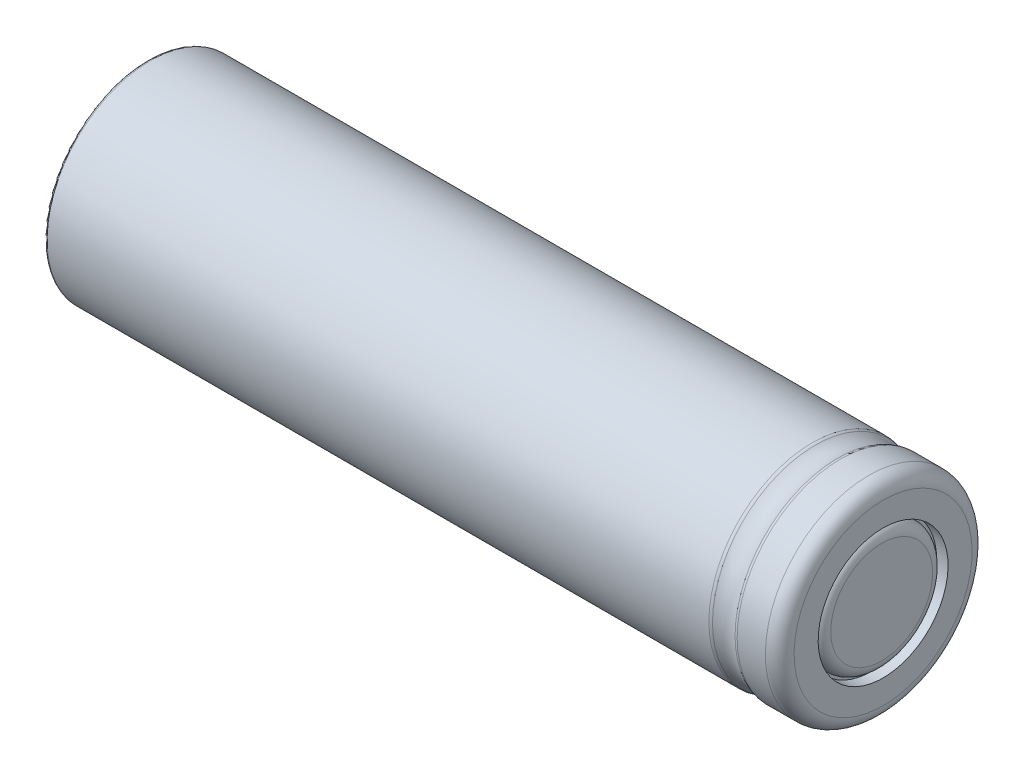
ISO-10303-21;
HEADER;
FILE_DESCRIPTION(('STEP AP214'),'2;1');
FILE_NAME('part.step','',(''),(''),'','','');
FILE_SCHEMA(('AUTOMOTIVE_DESIGN { 1 0 10303 214 1 1 1 1 }'));
ENDSEC;
DATA;
#1=APPLICATION_CONTEXT('core data for automotive mechanical design processes');
#2=APPLICATION_PROTOCOL_DEFINITION('international standard','automotive_design',2000,#1);
#3=PRODUCT_CONTEXT('',#1,'mechanical');
#4=PRODUCT('Part','Part','',(#3));
#5=PRODUCT_RELATED_PRODUCT_CATEGORY('part','',(#4));
#6=PRODUCT_DEFINITION_FORMATION('','',#4);
#7=PRODUCT_DEFINITION_CONTEXT('part definition',#1,'design');
#8=PRODUCT_DEFINITION('design','',#6,#7);
#9=PRODUCT_DEFINITION_SHAPE('','',#8);
#10=(LENGTH_UNIT() NAMED_UNIT(*) SI_UNIT(.MILLI.,.METRE.));
#11=(NAMED_UNIT(*) PLANE_ANGLE_UNIT() SI_UNIT($,.RADIAN.));
#12=(NAMED_UNIT(*) SI_UNIT($,.STERADIAN.) SOLID_ANGLE_UNIT());
#13=UNCERTAINTY_MEASURE_WITH_UNIT(LENGTH_MEASURE(1.E-05),#10,'distance_accuracy_value','');
#14=(GEOMETRIC_REPRESENTATION_CONTEXT(3) GLOBAL_UNCERTAINTY_ASSIGNED_CONTEXT((#13)) GLOBAL_UNIT_ASSIGNED_CONTEXT((#10,
#11,#12)) REPRESENTATION_CONTEXT('',''));
#15=CARTESIAN_POINT('',(0.,0.,0.));
#16=DIRECTION('',(0.,0.,1.));
#17=DIRECTION('',(1.,0.,0.));
#18=AXIS2_PLACEMENT_3D('',#15,#16,#17);
#19=CARTESIAN_POINT('',(64.084,0.,0.));
#20=DIRECTION('',(1.,0.,0.));
#21=DIRECTION('',(0.,1.,0.));
#22=AXIS2_PLACEMENT_3D('',#19,#20,#21);
#23=PLANE('',#22);
#24=CARTESIAN_POINT('',(64.084,0.,0.));
#25=DIRECTION('',(1.,0.,0.));
#26=DIRECTION('',(0.,1.,0.));
#27=AXIS2_PLACEMENT_3D('',#24,#25,#26);
#28=CIRCLE('',#27,5.75);
#29=CARTESIAN_POINT('',(64.084,5.75,0.));
#30=VERTEX_POINT('',#29);
#31=EDGE_CURVE('E71',#30,#30,#28,.T.);
#32=ORIENTED_EDGE('',*,*,#31,.T.);
#33=EDGE_LOOP('',(#32));
#34=FACE_BOUND('',#33,.T.);
#35=CARTESIAN_POINT('',(64.084,0.,0.));
#36=DIRECTION('',(1.,0.,0.));
#37=DIRECTION('',(0.,1.,0.));
#38=AXIS2_PLACEMENT_3D('',#35,#36,#37);
#39=CIRCLE('',#38,5.5);
#40=CARTESIAN_POINT('',(64.084,5.5,0.));
#41=VERTEX_POINT('',#40);
#42=EDGE_CURVE('E75',#41,#41,#39,.T.);
#43=ORIENTED_EDGE('',*,*,#42,.F.);
#44=EDGE_LOOP('',(#43));
#45=FACE_BOUND('',#44,.T.);
#46=ADVANCED_FACE('F36',(#34,#45),#23,.T.);
#47=CARTESIAN_POINT('',(65.1,7.87999999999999,0.));
#48=DIRECTION('',(1.,0.,0.));
#49=DIRECTION('',(0.,1.,0.));
#50=AXIS2_PLACEMENT_3D('',#47,#48,#49);
#51=PLANE('',#50);
#52=CARTESIAN_POINT('',(65.1,0.,0.));
#53=DIRECTION('',(1.,0.,0.));
#54=DIRECTION('',(0.,1.,0.));
#55=AXIS2_PLACEMENT_3D('',#52,#53,#54);
#56=CIRCLE('',#55,5.75);
#57=CARTESIAN_POINT('',(65.1,5.75,0.));
#58=VERTEX_POINT('',#57);
#59=EDGE_CURVE('E72',#58,#58,#56,.T.);
#60=ORIENTED_EDGE('',*,*,#59,.F.);
#61=EDGE_LOOP('',(#60));
#62=FACE_BOUND('',#61,.T.);
#63=CARTESIAN_POINT('',(65.1,0.,0.));
#64=DIRECTION('',(1.,0.,0.));
#65=DIRECTION('',(0.,1.,0.));
#66=AXIS2_PLACEMENT_3D('',#63,#64,#65);
#67=CIRCLE('',#66,7.87999999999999);
#68=CARTESIAN_POINT('',(65.1,7.87999999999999,0.));
#69=VERTEX_POINT('',#68);
#70=EDGE_CURVE('E43',#69,#69,#67,.T.);
#71=ORIENTED_EDGE('',*,*,#70,.T.);
#72=EDGE_LOOP('',(#71));
#73=FACE_BOUND('',#72,.T.);
#74=ADVANCED_FACE('F141',(#62,#73),#51,.T.);
#75=CARTESIAN_POINT('',(63.83,0.,0.));
#76=DIRECTION('',(1.,0.,0.));
#77=DIRECTION('',(0.,1.,0.));
#78=AXIS2_PLACEMENT_3D('',#75,#76,#77);
#79=TOROIDAL_SURFACE('',#78,7.87999999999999,1.27);
#80=CARTESIAN_POINT('',(63.83,0.,0.));
#81=DIRECTION('',(1.,0.,0.));
#82=DIRECTION('',(0.,1.,0.));
#83=AXIS2_PLACEMENT_3D('',#80,#81,#82);
#84=CIRCLE('',#83,9.14999999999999);
#85=CARTESIAN_POINT('',(63.83,9.14999999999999,0.));
#86=VERTEX_POINT('',#85);
#87=EDGE_CURVE('E47',#86,#86,#84,.T.);
#88=ORIENTED_EDGE('',*,*,#87,.T.);
#89=EDGE_LOOP('',(#88));
#90=FACE_BOUND('',#89,.T.);
#91=ORIENTED_EDGE('',*,*,#70,.F.);
#92=EDGE_LOOP('',(#91));
#93=FACE_BOUND('',#92,.T.);
#94=ADVANCED_FACE('F136',(#90,#93),#79,.T.);
#95=CARTESIAN_POINT('',(65.1,0.,0.));
#96=DIRECTION('',(1.,0.,0.));
#97=DIRECTION('',(0.,1.,0.));
#98=AXIS2_PLACEMENT_3D('',#95,#96,#97);
#99=CYLINDRICAL_SURFACE('',#98,9.14999999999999);
#100=CARTESIAN_POINT('',(61.33,0.,0.));
#101=DIRECTION('',(-1.,0.,0.));
#102=DIRECTION('',(0.,0.,1.));
#103=AXIS2_PLACEMENT_3D('',#100,#101,#102);
#104=CIRCLE('',#103,9.14999999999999);
#105=CARTESIAN_POINT('',(61.33,0.,9.14999999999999));
#106=VERTEX_POINT('',#105);
#107=EDGE_CURVE('E59',#106,#106,#104,.T.);
#108=ORIENTED_EDGE('',*,*,#107,.F.);
#109=EDGE_LOOP('',(#108));
#110=FACE_BOUND('',#109,.T.);
#111=ORIENTED_EDGE('',*,*,#87,.F.);
#112=EDGE_LOOP('',(#111));
#113=FACE_BOUND('',#112,.T.);
#114=ADVANCED_FACE('F114',(#110,#113),#99,.T.);
#115=CARTESIAN_POINT('',(61.33,0.,0.));
#116=DIRECTION('',(-1.,0.,0.));
#117=DIRECTION('',(0.,0.,1.));
#118=AXIS2_PLACEMENT_3D('',#115,#116,#117);
#119=TOROIDAL_SURFACE('',#118,8.64999999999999,0.499999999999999);
#120=CARTESIAN_POINT('',(61.08,0.,0.));
#121=DIRECTION('',(-1.,0.,0.));
#122=DIRECTION('',(0.,0.,1.));
#123=AXIS2_PLACEMENT_3D('',#120,#121,#122);
#124=CIRCLE('',#123,9.08301270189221);
#125=CARTESIAN_POINT('',(61.08,0.,9.08301270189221));
#126=VERTEX_POINT('',#125);
#127=EDGE_CURVE('E68',#126,#126,#124,.T.);
#128=ORIENTED_EDGE('',*,*,#127,.F.);
#129=EDGE_LOOP('',(#128));
#130=FACE_BOUND('',#129,.T.);
#131=ORIENTED_EDGE('',*,*,#107,.T.);
#132=EDGE_LOOP('',(#131));
#133=FACE_BOUND('',#132,.T.);
#134=ADVANCED_FACE('F120',(#130,#133),#119,.T.);
#135=CARTESIAN_POINT('',(58.83,0.,0.));
#136=DIRECTION('',(-1.,0.,0.));
#137=DIRECTION('',(0.,0.,1.));
#138=AXIS2_PLACEMENT_3D('',#135,#136,#137);
#139=TOROIDAL_SURFACE('',#138,8.64999999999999,0.500000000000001);
#140=CARTESIAN_POINT('',(58.83,0.,0.));
#141=DIRECTION('',(-1.,0.,0.));
#142=DIRECTION('',(0.,0.,1.));
#143=AXIS2_PLACEMENT_3D('',#140,#141,#142);
#144=CIRCLE('',#143,9.14999999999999);
#145=CARTESIAN_POINT('',(58.83,0.,9.14999999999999));
#146=VERTEX_POINT('',#145);
#147=EDGE_CURVE('E62',#146,#146,#144,.T.);
#148=ORIENTED_EDGE('',*,*,#147,.F.);
#149=EDGE_LOOP('',(#148));
#150=FACE_BOUND('',#149,.T.);
#151=CARTESIAN_POINT('',(59.08,0.,0.));
#152=DIRECTION('',(-1.,0.,0.));
#153=DIRECTION('',(0.,0.,1.));
#154=AXIS2_PLACEMENT_3D('',#151,#152,#153);
#155=CIRCLE('',#154,9.08301270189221);
#156=CARTESIAN_POINT('',(59.08,0.,9.08301270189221));
#157=VERTEX_POINT('',#156);
#158=EDGE_CURVE('E65',#157,#157,#155,.T.);
#159=ORIENTED_EDGE('',*,*,#158,.T.);
#160=EDGE_LOOP('',(#159));
#161=FACE_BOUND('',#160,.T.);
#162=ADVANCED_FACE('F117',(#150,#161),#139,.T.);
#163=CARTESIAN_POINT('',(60.08,0.,0.));
#164=DIRECTION('',(-1.,0.,0.));
#165=DIRECTION('',(0.,0.,1.));
#166=AXIS2_PLACEMENT_3D('',#163,#164,#165);
#167=TOROIDAL_SURFACE('',#166,10.8150635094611,2.);
#168=ORIENTED_EDGE('',*,*,#158,.F.);
#169=EDGE_LOOP('',(#168));
#170=FACE_BOUND('',#169,.T.);
#171=ORIENTED_EDGE('',*,*,#127,.T.);
#172=EDGE_LOOP('',(#171));
#173=FACE_BOUND('',#172,.T.);
#174=ADVANCED_FACE('F100',(#170,#173),#167,.F.);
#175=CARTESIAN_POINT('',(0.,0.,0.));
#176=DIRECTION('',(-1.,0.,0.));
#177=DIRECTION('',(0.,-1.,0.));
#178=AXIS2_PLACEMENT_3D('',#175,#176,#177);
#179=PLANE('',#178);
#180=CARTESIAN_POINT('',(0.,0.,0.));
#181=DIRECTION('',(-1.,0.,0.));
#182=DIRECTION('',(0.,-1.,0.));
#183=AXIS2_PLACEMENT_3D('',#180,#181,#182);
#184=CIRCLE('',#183,7.5);
#185=CARTESIAN_POINT('',(0.,-7.5,0.));
#186=VERTEX_POINT('',#185);
#187=EDGE_CURVE('E81',#186,#186,#184,.T.);
#188=ORIENTED_EDGE('',*,*,#187,.F.);
#189=EDGE_LOOP('',(#188));
#190=FACE_BOUND('',#189,.T.);
#191=CARTESIAN_POINT('',(0.,0.,0.));
#192=DIRECTION('',(1.,0.,0.));
#193=DIRECTION('',(0.,1.,0.));
#194=AXIS2_PLACEMENT_3D('',#191,#192,#193);
#195=CIRCLE('',#194,8.89599999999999);
#196=CARTESIAN_POINT('',(0.,8.89599999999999,0.));
#197=VERTEX_POINT('',#196);
#198=EDGE_CURVE('E56',#197,#197,#195,.T.);
#199=ORIENTED_EDGE('',*,*,#198,.F.);
#200=EDGE_LOOP('',(#199));
#201=FACE_BOUND('',#200,.T.);
#202=ADVANCED_FACE('F96',(#190,#201),#179,.T.);
#203=CARTESIAN_POINT('',(0.254,0.,0.));
#204=DIRECTION('',(1.,0.,0.));
#205=DIRECTION('',(0.,1.,0.));
#206=AXIS2_PLACEMENT_3D('',#203,#204,#205);
#207=TOROIDAL_SURFACE('',#206,8.89599999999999,0.254);
#208=ORIENTED_EDGE('',*,*,#198,.T.);
#209=EDGE_LOOP('',(#208));
#210=FACE_BOUND('',#209,.T.);
#211=CARTESIAN_POINT('',(0.254000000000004,0.,0.));
#212=DIRECTION('',(1.,0.,0.));
#213=DIRECTION('',(0.,1.,0.));
#214=AXIS2_PLACEMENT_3D('',#211,#212,#213);
#215=CIRCLE('',#214,9.14999999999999);
#216=CARTESIAN_POINT('',(0.254000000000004,9.14999999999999,0.));
#217=VERTEX_POINT('',#216);
#218=EDGE_CURVE('E51',#217,#217,#215,.T.);
#219=ORIENTED_EDGE('',*,*,#218,.F.);
#220=EDGE_LOOP('',(#219));
#221=FACE_BOUND('',#220,.T.);
#222=ADVANCED_FACE('F99',(#210,#221),#207,.T.);
#223=ORIENTED_EDGE('',*,*,#218,.T.);
#224=EDGE_LOOP('',(#223));
#225=FACE_BOUND('',#224,.T.);
#226=ORIENTED_EDGE('',*,*,#147,.T.);
#227=EDGE_LOOP('',(#226));
#228=FACE_BOUND('',#227,.T.);
#229=ADVANCED_FACE('F106',(#225,#228),#99,.T.);
#230=CARTESIAN_POINT('',(64.084,0.,0.));
#231=DIRECTION('',(1.,0.,0.));
#232=DIRECTION('',(0.,1.,0.));
#233=AXIS2_PLACEMENT_3D('',#230,#231,#232);
#234=CYLINDRICAL_SURFACE('',#233,5.75);
#235=ORIENTED_EDGE('',*,*,#31,.F.);
#236=EDGE_LOOP('',(#235));
#237=FACE_BOUND('',#236,.T.);
#238=ORIENTED_EDGE('',*,*,#59,.T.);
#239=EDGE_LOOP('',(#238));
#240=FACE_BOUND('',#239,.T.);
#241=ADVANCED_FACE('F112',(#237,#240),#234,.F.);
#242=CARTESIAN_POINT('',(64.973,7.87999999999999,0.));
#243=DIRECTION('',(1.,0.,0.));
#244=DIRECTION('',(0.,1.,0.));
#245=AXIS2_PLACEMENT_3D('',#242,#243,#244);
#246=PLANE('',#245);
#247=CARTESIAN_POINT('',(64.973,0.,0.));
#248=DIRECTION('',(1.,0.,0.));
#249=DIRECTION('',(0.,1.,0.));
#250=AXIS2_PLACEMENT_3D('',#247,#248,#249);
#251=CIRCLE('',#250,4.50617959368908);
#252=CARTESIAN_POINT('',(64.973,4.50617959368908,0.));
#253=VERTEX_POINT('',#252);
#254=EDGE_CURVE('E11',#253,#253,#251,.T.);
#255=ORIENTED_EDGE('',*,*,#254,.T.);
#256=EDGE_LOOP('',(#255));
#257=FACE_BOUND('',#256,.T.);
#258=ADVANCED_FACE('F92',(#257),#246,.T.);
#259=CARTESIAN_POINT('',(0.0254,0.,0.));
#260=DIRECTION('',(-1.,0.,0.));
#261=DIRECTION('',(0.,-1.,0.));
#262=AXIS2_PLACEMENT_3D('',#259,#260,#261);
#263=CYLINDRICAL_SURFACE('',#262,7.5);
#264=CARTESIAN_POINT('',(0.0254,0.,0.));
#265=DIRECTION('',(-1.,0.,0.));
#266=DIRECTION('',(0.,-1.,0.));
#267=AXIS2_PLACEMENT_3D('',#264,#265,#266);
#268=CIRCLE('',#267,7.5);
#269=CARTESIAN_POINT('',(0.0254000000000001,-7.5,0.));
#270=VERTEX_POINT('',#269);
#271=EDGE_CURVE('E80',#270,#270,#268,.T.);
#272=ORIENTED_EDGE('',*,*,#271,.F.);
#273=EDGE_LOOP('',(#272));
#274=FACE_BOUND('',#273,.T.);
#275=ORIENTED_EDGE('',*,*,#187,.T.);
#276=EDGE_LOOP('',(#275));
#277=FACE_BOUND('',#276,.T.);
#278=ADVANCED_FACE('F89',(#274,#277),#263,.F.);
#279=CARTESIAN_POINT('',(0.0254,0.,0.));
#280=DIRECTION('',(-1.,0.,0.));
#281=DIRECTION('',(0.,-1.,0.));
#282=AXIS2_PLACEMENT_3D('',#279,#280,#281);
#283=PLANE('',#282);
#284=ORIENTED_EDGE('',*,*,#271,.T.);
#285=EDGE_LOOP('',(#284));
#286=FACE_BOUND('',#285,.T.);
#287=ADVANCED_FACE('F87',(#286),#283,.T.);
#288=CARTESIAN_POINT('',(63.973,0.,0.));
#289=DIRECTION('',(-1.,0.,0.));
#290=DIRECTION('',(0.,-1.,0.));
#291=AXIS2_PLACEMENT_3D('',#288,#289,#290);
#292=TOROIDAL_SURFACE('',#291,4.50617959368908,1.);
#293=ORIENTED_EDGE('',*,*,#42,.T.);
#294=EDGE_LOOP('',(#293));
#295=FACE_BOUND('',#294,.T.);
#296=ORIENTED_EDGE('',*,*,#254,.F.);
#297=EDGE_LOOP('',(#296));
#298=FACE_BOUND('',#297,.T.);
#299=ADVANCED_FACE('F38',(#295,#298),#292,.T.);
#300=CLOSED_SHELL('',(#46,#74,#94,#114,#134,#162,#174,#202,#222,#229,#241,#258,#278,#287,#299));
#301=MANIFOLD_SOLID_BREP('B2',#300);
#302=ADVANCED_BREP_SHAPE_REPRESENTATION('',(#18,#301),#14);
#303=SHAPE_DEFINITION_REPRESENTATION(#9,#302);
ENDSEC;
END-ISO-10303-21;
